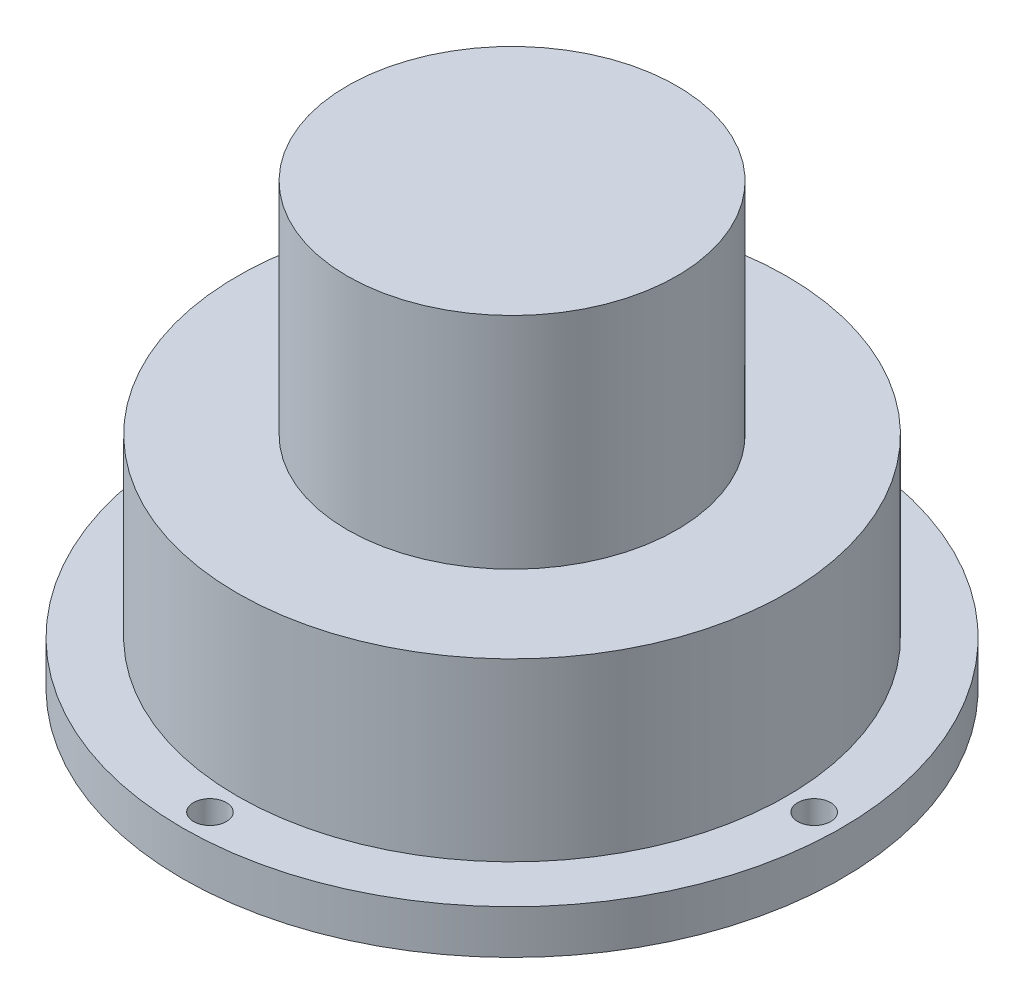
from build123d import *

# Parameters (mm, degrees)
SKETCH1_R                  = 150
SKETCH1_R_2                = 125
BOSS_EXTRUDE1_DEPTH        = 20
SKETCH1_2_R                = 125
BOSS_EXTRUDE2_DEPTH        = 100
SKETCH2_R                  = 75
BOSS_EXTRUDE3_DEPTH        = 100
F_15_0_15_DIAMETER_HOLE1_D = 15
CIRPATTERN1_COUNT          = 4
SCALE1_SCALE               = 0.5


with BuildPart() as part:
    # Sketch1 → Boss-Extrude1 (new body)
    with BuildSketch(Plane(origin=(0, 0, 0), x_dir=(1, 0, 0), z_dir=(0, 1, 0))):
        with Locations(Location((0, 0, 0), (0, 0, 270))):
            Circle(SKETCH1_R)
        with Locations(Location((0, 0, 0), (0, 0, 270))):
            Circle(SKETCH1_R_2, mode=Mode.SUBTRACT)
    extrude(amount=BOSS_EXTRUDE1_DEPTH)

    # Sketch1_2 → Boss-Extrude2 (add)
    with BuildSketch(Plane(origin=(0, 0, 0), x_dir=(1, 0, 0), z_dir=(0, 1, 0))):
        with Locations(Location((0, 0, 0), (0, 0, 270))):
            Circle(SKETCH1_2_R)
    extrude(amount=BOSS_EXTRUDE2_DEPTH)

    # Sketch2 → Boss-Extrude3 (add)
    with BuildSketch(Plane(origin=(0, 100, 0), x_dir=(1, 0, 0), z_dir=(0, 1, 0))):
        with Locations(Location((0, 0, 0), (0, 0, 270))):
            Circle(SKETCH2_R)
    extrude(amount=BOSS_EXTRUDE3_DEPTH)

    # 15.0 _15_ Diameter Hole1 (through all)
    with Locations(Plane(origin=(0, 20, 0), x_dir=(1, 0, 0), z_dir=(0, 1, 0))):
        with Locations((137.5, 0)):
            f_15_0_15_diameter_hole1 = Hole(F_15_0_15_DIAMETER_HOLE1_D / 2)

    # CirPattern1: 15.0 _15_ Diameter Hole1 ×4 about axis
    cirpattern1_axis = Axis((0, 0, 0), (0, 1, 0))
    for i in range(1, CIRPATTERN1_COUNT):
        add(f_15_0_15_diameter_hole1.rotate(cirpattern1_axis, i * 360 / CIRPATTERN1_COUNT), mode=Mode.SUBTRACT)


with BuildPart() as part_1:
    # Scale1: scaled about (0, 72.555358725, 0)
    add(part.part.scale(SCALE1_SCALE).moved(Location((0, 36.277679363, 0))))


solid = part_1.part
